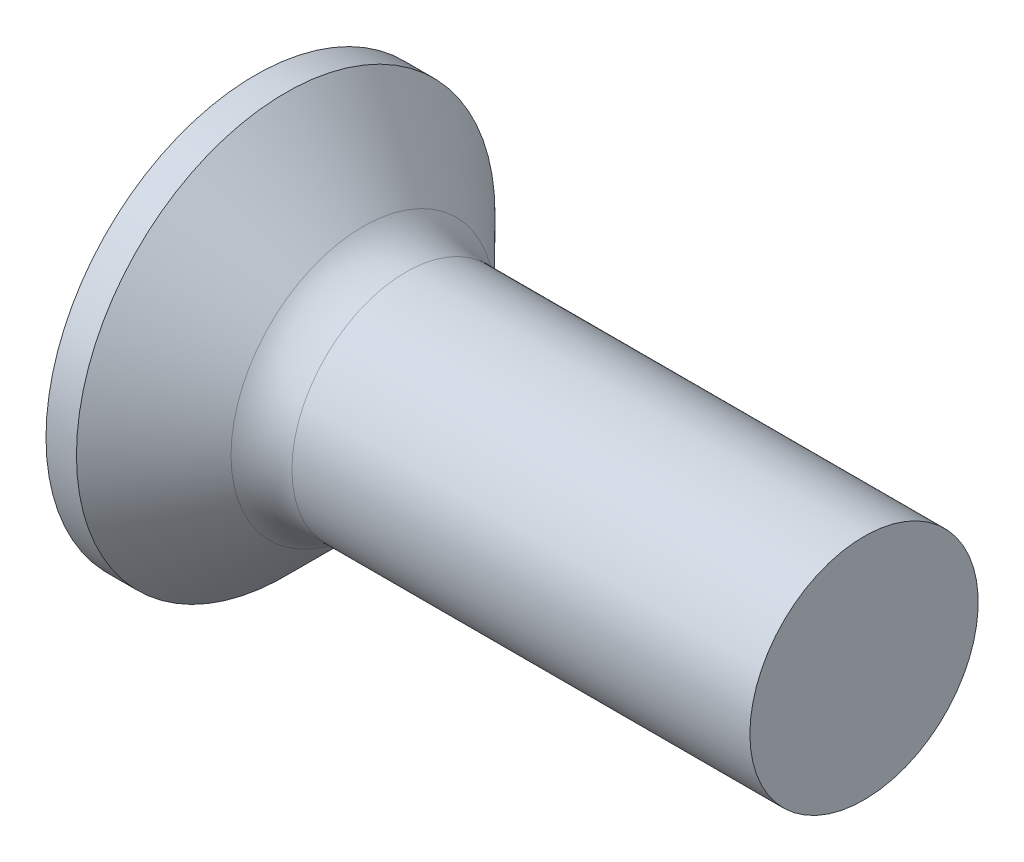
from build123d import *

# Parameters (mm, degrees)
FILLET1_R    = 0.8
RECPAT_COUNT = 2
RECPAT_ANGLE = 90


with BuildPart() as part:
    # BodySke → Base-Revolve (revolve)
    with BuildSketch(Plane.XY, mode=Mode.PRIVATE) as base_revolve_sk:
        Polygon((0, 0), (0, 2.75), (0.4, 2.75), (1.65, 1.5), (8, 1.5), (8, 0), align=None)
    revolve(base_revolve_sk.sketch.rotate(Axis((-6.35, 0, 0), (1, 0, 0)), 90), axis=Axis((-6.35, 0, 0), (1, 0, 0)))

    # Fillet1
    fillet1_edges = [part.edges().sort_by_distance(p)[0] for p in [
        (1.65, 0, -1.5),
    ]]
    fillet(fillet1_edges, radius=FILLET1_R)

    # Sketch3 → Recess section 0
    with BuildSketch(Plane.ZY):
        with BuildLine():
            Line((-0.37, 1.5), (0.37, 1.5))
            Line((0.37, 1.5), (0.37, -1.5))
            Line((0.37, -1.5), (-0.37, -1.5))
            Line((-0.37, -1.5), (-0.37, 1.5))
        make_face()
    # Sketch4 → Recess section 1
    with BuildSketch(Plane.ZY.offset(-2.01)):
        with BuildLine():
            Line((-0.37, 0.497851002), (0.37, 0.497851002))
            Line((0.37, 0.497851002), (0.37, -0.497851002))
            Line((0.37, -0.497851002), (-0.37, -0.497851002))
            Line((-0.37, -0.497851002), (-0.37, 0.497851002))
        make_face()
    recess = loft(mode=Mode.SUBTRACT)

    # RecPat: Recess ×2 about axis
    recpat_axis = Axis((0, 0, 0), (1, 0, 0))
    for i in range(1, RECPAT_COUNT):
        add(recess.rotate(recpat_axis, i * RECPAT_ANGLE / (RECPAT_COUNT - 1)), mode=Mode.SUBTRACT)

    # RecCorSke → RecessCore (revolve, cut)
    with BuildSketch(Plane.XY, mode=Mode.PRIVATE) as recesscore_sk:
        Polygon((0, 0), (0, 0.696552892), (2.01, 0.556), (2.190655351, 0), align=None)
    revolve(recesscore_sk.sketch.rotate(Axis((-3.175, 0, 0), (1, 0, 0)), 90), axis=Axis((-3.175, 0, 0), (1, 0, 0)), mode=Mode.SUBTRACT)


solid = part.part
